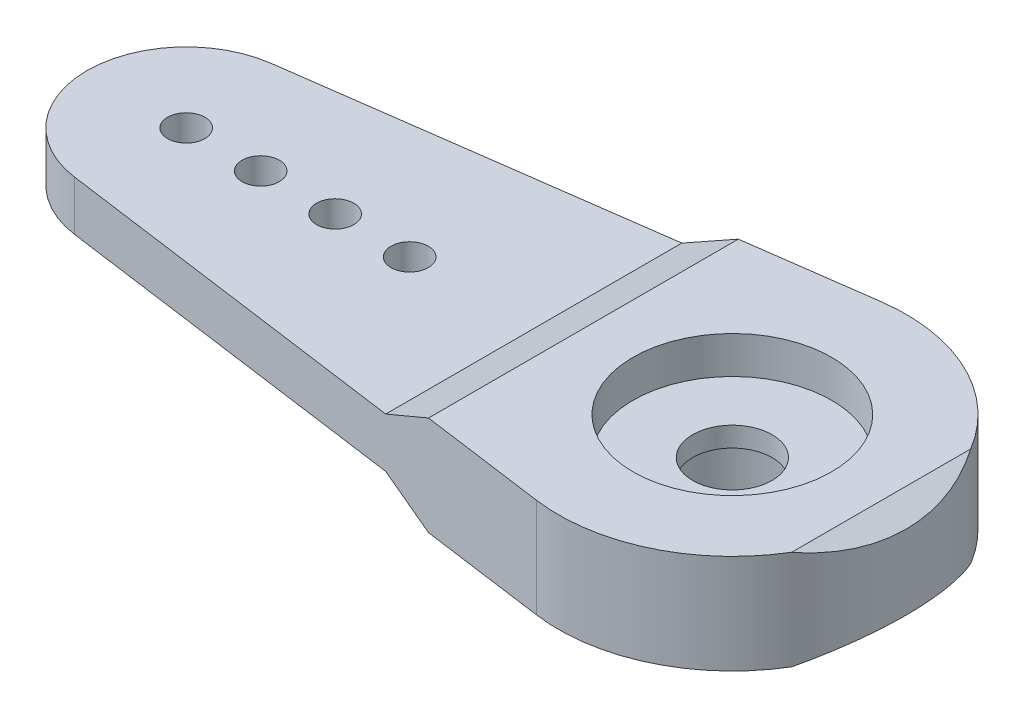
from build123d import *

# Parameters (mm, degrees)
EXTRUSION6_DEPTH        = 15
ESQUISSE8_W             = 60
ESQUISSE8_H             = 30
ENL_V_MAT_EXTRU_4_DEPTH = 34.778691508
ESQUISSE9_R             = 4
ENL_V_MAT_EXTRU_5_DEPTH = 1.5
ESQUISSE10_R            = 5
EXTRUSION7_DEPTH        = 0.5
ESQUISSE11_R            = 5
EXTRUSION8_DEPTH        = 1.5
EXTRUSION8_TAPER        = 45
ESQUISSE12_R            = 0.75
ENL_V_MAT_EXTRU_6_DEPTH = 28.386127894
ESQUISSE13_R            = 2.9
EXTRUSION9_DEPTH        = 3.7
ESQUISSE14_R            = 1.6
ENL_V_MAT_EXTRU_7_DEPTH = 28.299267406


with BuildPart() as part:
    # Esquisse1 → Extrusion6 (new, symmetric)
    with BuildSketch(Plane.XY):
        Polygon((-30, 3), (-8, 3), (-6, 4), (6, 4), (8, 3), (30, 3), (30, 1), (8, 1), (6, 0), (-6, 0), (-8, 1), (-30, 1), align=None)
    extrude(amount=EXTRUSION6_DEPTH, both=True)

    # Esquisse8 → Enl_v. mat.-Extru.4 (cut, through all)
    with BuildSketch(Plane(origin=(0, 4, 0), x_dir=(1, 0, 0), z_dir=(0, 1, 0))):
        Rectangle(ESQUISSE8_W, ESQUISSE8_H)
        with BuildLine():
            Line((-22.545454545, 3.962635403), (-0.954545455, 6.934611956))
            ThreePointArc((-0.954545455, 6.934611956), (7, 0), (-0.954545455, -6.934611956))
            Line((-0.954545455, -6.934611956), (-22.545454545, -3.962635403))
            ThreePointArc((-22.545454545, -3.962635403), (-26, 0), (-22.545454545, 3.962635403))
        make_face(mode=Mode.SUBTRACT)
    extrude(amount=-ENL_V_MAT_EXTRU_4_DEPTH, mode=Mode.SUBTRACT)

    # Esquisse9 → Enl_v. mat.-Extru.5 (cut)
    with BuildSketch(Plane(origin=(0, 4, 0), x_dir=(1, 0, 0), z_dir=(0, 1, 0))):
        with Locations(Location((0, 0, 0), (0, 0, 270))):
            Circle(ESQUISSE9_R)
    extrude(amount=-ENL_V_MAT_EXTRU_5_DEPTH, mode=Mode.SUBTRACT)

    # Esquisse10 → Extrusion7 (add)
    with BuildSketch(Plane.XZ):
        with Locations(Location((0, 0, 0), (0, 0, 90))):
            Circle(ESQUISSE10_R)
    extrude(amount=EXTRUSION7_DEPTH)

    # Esquisse11 → Extrusion8 (add)
    with BuildSketch(Plane.XZ.offset(0.5)):
        with Locations(Location((0, 0, 0), (0, 0, 90))):
            Circle(ESQUISSE11_R)
    extrude(amount=EXTRUSION8_DEPTH, taper=EXTRUSION8_TAPER)

    # Esquisse12 → Enl_v. mat.-Extru.6 (cut, through all)
    with BuildSketch(Plane(origin=(0, 3, 0), x_dir=(1, 0, 0), z_dir=(0, 1, 0))):
        with Locations(Location((-13, 0, 0), (0, 0, 270))):
            Circle(ESQUISSE12_R)
        with Locations(Location((-16, 0, 0), (0, 0, 270))):
            Circle(ESQUISSE12_R)
        with Locations(Location((-19, 0, 0), (0, 0, 270))):
            Circle(ESQUISSE12_R)
        with Locations(Location((-22, 0, 0), (0, 0, 270))):
            Circle(ESQUISSE12_R)
    extrude(amount=-ENL_V_MAT_EXTRU_6_DEPTH, mode=Mode.SUBTRACT)

    # Esquisse13 → Extrusion9 (cut)
    with BuildSketch(Plane.XZ.offset(2)):
        with Locations(Location((0, 0, 0), (0, 0, 270))):
            Circle(ESQUISSE13_R)
    extrude(amount=-EXTRUSION9_DEPTH, mode=Mode.SUBTRACT)

    # Esquisse14 → Enl_v. mat.-Extru.7 (cut, through all)
    with BuildSketch(Plane(origin=(0, 2.5, 0), x_dir=(1, 0, 0), z_dir=(0, 1, 0))):
        with Locations(Location((0, 0, 0), (0, 0, 270))):
            Circle(ESQUISSE14_R)
    extrude(amount=-ENL_V_MAT_EXTRU_7_DEPTH, mode=Mode.SUBTRACT)


solid = part.part
